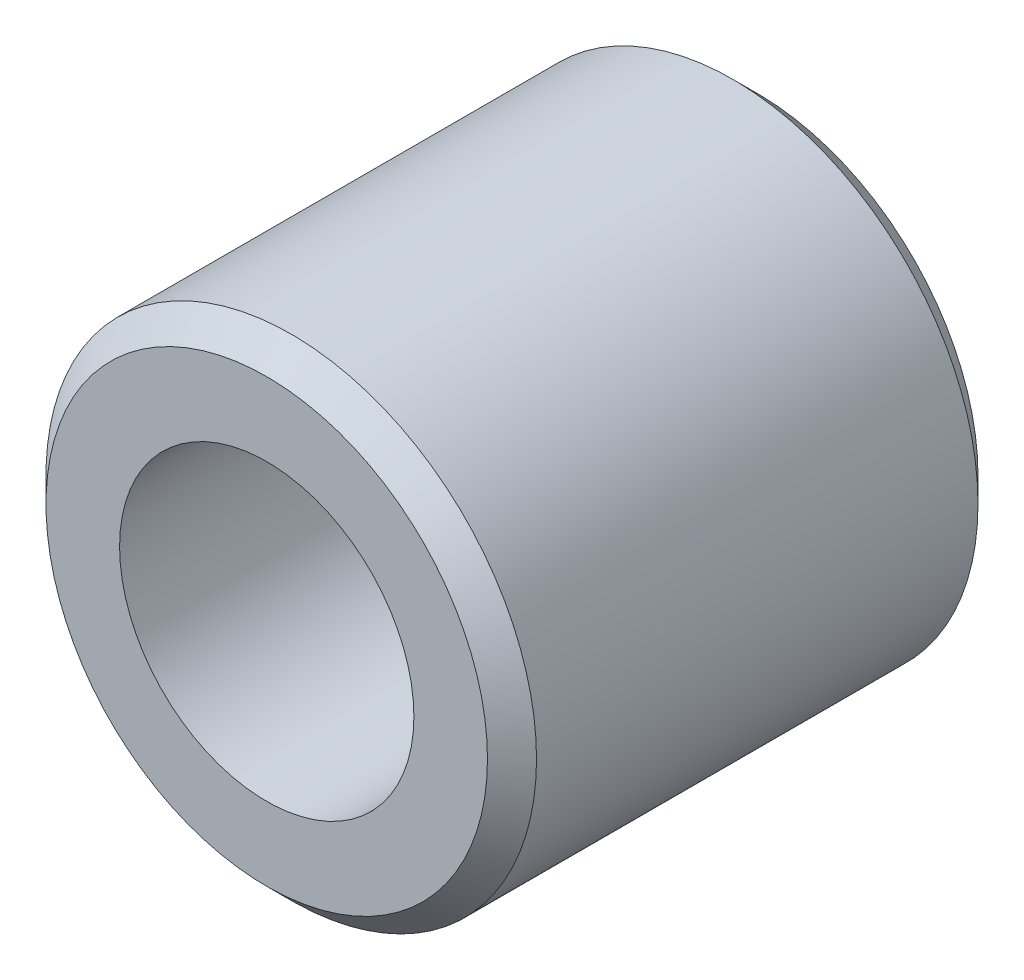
ISO-10303-21;
HEADER;
FILE_DESCRIPTION(('STEP AP214'),'2;1');
FILE_NAME('part.step','',(''),(''),'','','');
FILE_SCHEMA(('AUTOMOTIVE_DESIGN { 1 0 10303 214 1 1 1 1 }'));
ENDSEC;
DATA;
#1=APPLICATION_CONTEXT('core data for automotive mechanical design processes');
#2=APPLICATION_PROTOCOL_DEFINITION('international standard','automotive_design',2000,#1);
#3=PRODUCT_CONTEXT('',#1,'mechanical');
#4=PRODUCT('Part','Part','',(#3));
#5=PRODUCT_RELATED_PRODUCT_CATEGORY('part','',(#4));
#6=PRODUCT_DEFINITION_FORMATION('','',#4);
#7=PRODUCT_DEFINITION_CONTEXT('part definition',#1,'design');
#8=PRODUCT_DEFINITION('design','',#6,#7);
#9=PRODUCT_DEFINITION_SHAPE('','',#8);
#10=(LENGTH_UNIT() NAMED_UNIT(*) SI_UNIT(.MILLI.,.METRE.));
#11=(NAMED_UNIT(*) PLANE_ANGLE_UNIT() SI_UNIT($,.RADIAN.));
#12=(NAMED_UNIT(*) SI_UNIT($,.STERADIAN.) SOLID_ANGLE_UNIT());
#13=UNCERTAINTY_MEASURE_WITH_UNIT(LENGTH_MEASURE(1.E-05),#10,'distance_accuracy_value','');
#14=(GEOMETRIC_REPRESENTATION_CONTEXT(3) GLOBAL_UNCERTAINTY_ASSIGNED_CONTEXT((#13)) GLOBAL_UNIT_ASSIGNED_CONTEXT((#10,
#11,#12)) REPRESENTATION_CONTEXT('',''));
#15=CARTESIAN_POINT('',(0.,0.,0.));
#16=DIRECTION('',(0.,0.,1.));
#17=DIRECTION('',(1.,0.,0.));
#18=AXIS2_PLACEMENT_3D('',#15,#16,#17);
#19=CARTESIAN_POINT('',(0.,0.,9.99999999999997));
#20=DIRECTION('',(0.,0.,1.));
#21=DIRECTION('',(1.,0.,0.));
#22=AXIS2_PLACEMENT_3D('',#19,#20,#21);
#23=PLANE('',#22);
#24=CARTESIAN_POINT('',(0.,0.,9.99999999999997));
#25=DIRECTION('',(0.,0.,1.));
#26=DIRECTION('',(1.,0.,0.));
#27=AXIS2_PLACEMENT_3D('',#24,#25,#26);
#28=CIRCLE('',#27,4.5);
#29=CARTESIAN_POINT('',(4.5,0.,9.99999999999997));
#30=VERTEX_POINT('',#29);
#31=EDGE_CURVE('E10',#30,#30,#28,.T.);
#32=ORIENTED_EDGE('',*,*,#31,.T.);
#33=EDGE_LOOP('',(#32));
#34=FACE_BOUND('',#33,.T.);
#35=CARTESIAN_POINT('',(0.,0.,9.99999999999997));
#36=DIRECTION('',(0.,0.,1.));
#37=DIRECTION('',(1.,0.,0.));
#38=AXIS2_PLACEMENT_3D('',#35,#36,#37);
#39=CIRCLE('',#38,3.);
#40=CARTESIAN_POINT('',(3.,0.,9.99999999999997));
#41=VERTEX_POINT('',#40);
#42=EDGE_CURVE('E55',#41,#41,#39,.T.);
#43=ORIENTED_EDGE('',*,*,#42,.F.);
#44=EDGE_LOOP('',(#43));
#45=FACE_BOUND('',#44,.T.);
#46=ADVANCED_FACE('F35',(#34,#45),#23,.T.);
#47=CARTESIAN_POINT('',(0.,0.,0.));
#48=DIRECTION('',(0.,0.,1.));
#49=DIRECTION('',(1.,0.,0.));
#50=AXIS2_PLACEMENT_3D('',#47,#48,#49);
#51=PLANE('',#50);
#52=CARTESIAN_POINT('',(0.,0.,0.));
#53=DIRECTION('',(0.,0.,1.));
#54=DIRECTION('',(1.,0.,0.));
#55=AXIS2_PLACEMENT_3D('',#52,#53,#54);
#56=CIRCLE('',#55,4.5);
#57=CARTESIAN_POINT('',(4.5,0.,0.));
#58=VERTEX_POINT('',#57);
#59=EDGE_CURVE('E42',#58,#58,#56,.F.);
#60=ORIENTED_EDGE('',*,*,#59,.T.);
#61=EDGE_LOOP('',(#60));
#62=FACE_BOUND('',#61,.T.);
#63=CARTESIAN_POINT('',(0.,0.,0.));
#64=DIRECTION('',(0.,0.,1.));
#65=DIRECTION('',(1.,0.,0.));
#66=AXIS2_PLACEMENT_3D('',#63,#64,#65);
#67=CIRCLE('',#66,3.);
#68=CARTESIAN_POINT('',(3.,0.,0.));
#69=VERTEX_POINT('',#68);
#70=EDGE_CURVE('E58',#69,#69,#67,.T.);
#71=ORIENTED_EDGE('',*,*,#70,.T.);
#72=EDGE_LOOP('',(#71));
#73=FACE_BOUND('',#72,.T.);
#74=ADVANCED_FACE('F62',(#62,#73),#51,.F.);
#75=CARTESIAN_POINT('',(0.,0.,9.99999999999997));
#76=DIRECTION('',(0.,0.,-1.));
#77=DIRECTION('',(-1.,0.,0.));
#78=AXIS2_PLACEMENT_3D('',#75,#76,#77);
#79=CYLINDRICAL_SURFACE('',#78,5.);
#80=CARTESIAN_POINT('',(0.,0.,0.500000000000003));
#81=DIRECTION('',(0.,0.,1.));
#82=DIRECTION('',(1.,0.,0.));
#83=AXIS2_PLACEMENT_3D('',#80,#81,#82);
#84=CIRCLE('',#83,5.);
#85=CARTESIAN_POINT('',(5.,0.,0.500000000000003));
#86=VERTEX_POINT('',#85);
#87=EDGE_CURVE('E46',#86,#86,#84,.T.);
#88=ORIENTED_EDGE('',*,*,#87,.T.);
#89=EDGE_LOOP('',(#88));
#90=FACE_BOUND('',#89,.T.);
#91=CARTESIAN_POINT('',(0.,0.,9.49999999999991));
#92=DIRECTION('',(0.,0.,1.));
#93=DIRECTION('',(1.,0.,0.));
#94=AXIS2_PLACEMENT_3D('',#91,#92,#93);
#95=CIRCLE('',#94,5.);
#96=CARTESIAN_POINT('',(5.,0.,9.49999999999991));
#97=VERTEX_POINT('',#96);
#98=EDGE_CURVE('E50',#97,#97,#95,.F.);
#99=ORIENTED_EDGE('',*,*,#98,.T.);
#100=EDGE_LOOP('',(#99));
#101=FACE_BOUND('',#100,.T.);
#102=ADVANCED_FACE('F37',(#90,#101),#79,.T.);
#103=CARTESIAN_POINT('',(0.,0.,9.99999999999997));
#104=DIRECTION('',(0.,0.,-1.));
#105=DIRECTION('',(-1.,0.,0.));
#106=AXIS2_PLACEMENT_3D('',#103,#104,#105);
#107=CYLINDRICAL_SURFACE('',#106,3.);
#108=ORIENTED_EDGE('',*,*,#42,.T.);
#109=EDGE_LOOP('',(#108));
#110=FACE_BOUND('',#109,.T.);
#111=ORIENTED_EDGE('',*,*,#70,.F.);
#112=EDGE_LOOP('',(#111));
#113=FACE_BOUND('',#112,.T.);
#114=ADVANCED_FACE('F64',(#110,#113),#107,.F.);
#115=CARTESIAN_POINT('',(0.,0.,0.500000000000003));
#116=DIRECTION('',(0.,0.,1.));
#117=DIRECTION('',(1.,0.,0.));
#118=AXIS2_PLACEMENT_3D('',#115,#116,#117);
#119=CONICAL_SURFACE('',#118,5.,0.78539816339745);
#120=ORIENTED_EDGE('',*,*,#59,.F.);
#121=EDGE_LOOP('',(#120));
#122=FACE_BOUND('',#121,.T.);
#123=ORIENTED_EDGE('',*,*,#87,.F.);
#124=EDGE_LOOP('',(#123));
#125=FACE_BOUND('',#124,.T.);
#126=ADVANCED_FACE('F66',(#122,#125),#119,.T.);
#127=CARTESIAN_POINT('',(0.,0.,9.99999999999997));
#128=DIRECTION('',(0.,0.,-1.));
#129=DIRECTION('',(-1.,0.,0.));
#130=AXIS2_PLACEMENT_3D('',#127,#128,#129);
#131=CONICAL_SURFACE('',#130,4.5,0.785398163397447);
#132=ORIENTED_EDGE('',*,*,#98,.F.);
#133=EDGE_LOOP('',(#132));
#134=FACE_BOUND('',#133,.T.);
#135=ORIENTED_EDGE('',*,*,#31,.F.);
#136=EDGE_LOOP('',(#135));
#137=FACE_BOUND('',#136,.T.);
#138=ADVANCED_FACE('F73',(#134,#137),#131,.T.);
#139=CLOSED_SHELL('',(#46,#74,#102,#114,#126,#138));
#140=MANIFOLD_SOLID_BREP('B2',#139);
#141=ADVANCED_BREP_SHAPE_REPRESENTATION('',(#18,#140),#14);
#142=SHAPE_DEFINITION_REPRESENTATION(#9,#141);
ENDSEC;
END-ISO-10303-21;
